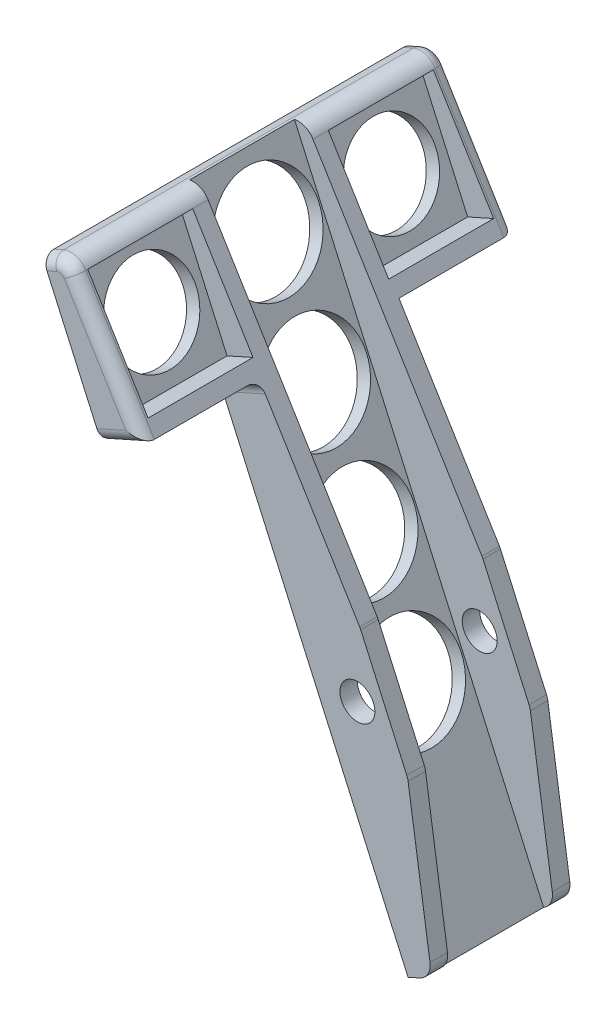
from build123d import *

# Parameters (mm, degrees)
ESQUISSE1_R             = 3.000000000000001
BOSS_EXTRU_1_DEPTH      = 3
BOSS_EXTRU_2_DEPTH      = 18
ESQUISSE4_R             = 3.0000000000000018
BOSS_EXTRU_3_DEPTH      = 3
CONG_1_R                = 3
CONG_2_R                = 3
ENL_V_MAT_EXTRU_2_DEPTH = 103.74467621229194
CONG_3_R                = 3
BOSS_EXTRU_4_DEPTH      = 20
BOSS_EXTRU_5_START      = 20
BOSS_EXTRU_5_DEPTH      = 20
CONG_4_R                = 2
ESQUISSE10_R            = 8.751073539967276
ESQUISSE10_R_2          = 8.751073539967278
ESQUISSE10_R_3          = 7.657402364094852
ESQUISSE10_R_4          = 7.657402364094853
ENL_V_MAT_EXTRU_3_DEPTH = 20
ESQUISSE13_W            = 18.028773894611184
ESQUISSE13_H            = 19.701931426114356
ENL_V_MAT_EXTRU_4_DEPTH = 20


with BuildPart() as part:
    # Esquisse1 → Boss.-Extru.1 (new body)
    with BuildSketch(Plane.XY.offset(-3.00000000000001)):
        Polygon((8.695260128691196, -5.909633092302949), (-34.11892264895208, 89.9650025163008), (-23.16182143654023, 94.8580519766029), (19.65236134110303, -1.0165836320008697), align=None)
        with Locations((0, 30.729041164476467)):
            Circle(ESQUISSE1_R, mode=Mode.SUBTRACT)
    extrude(amount=-BOSS_EXTRU_1_DEPTH)

    # Esquisse3 → Boss.-Extru.2 (add)
    with BuildSketch(Plane(origin=(0, 0, -6.000000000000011), x_dir=(-1, 0, 0), z_dir=(0, 0, -1))):
        Polygon((34.11892264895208, 89.9650025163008), (-8.695260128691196, -5.909633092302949), (-10.97798954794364, -4.890247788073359), (31.83619322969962, 90.98438782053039), align=None)
    extrude(amount=BOSS_EXTRU_2_DEPTH)

    # Esquisse4 → Boss.-Extru.3 (add)
    with BuildSketch(Plane(origin=(0, 0, -24.000000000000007), x_dir=(-1, 0, 0), z_dir=(0, 0, -1))):
        Polygon((-19.65236134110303, -1.0165836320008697), (-8.695260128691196, -5.909633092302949), (34.11892264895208, 89.9650025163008), (23.16182143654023, 94.8580519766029), align=None)
        with Locations(Location((0, 30.729041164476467, 0), (0, 0, 180))):
            Circle(ESQUISSE4_R, mode=Mode.SUBTRACT)
    extrude(amount=BOSS_EXTRU_3_DEPTH)

    # Cong_1
    cong_1_edges = [part.edges().sort_by_distance(p)[0] for p in [
        (19.65236134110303, -1.0165836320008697, -25.500000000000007),
        (19.65236134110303, -1.0165836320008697, -4.500000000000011),
    ]]
    fillet(cong_1_edges, radius=CONG_1_R)

    # Cong_2
    cong_2_edges = [part.edges().sort_by_distance(p)[0] for p in [
        (-23.16182143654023, 94.8580519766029, -25.500000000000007),
        (-23.16182143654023, 94.8580519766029, -4.500000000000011),
    ]]
    fillet(cong_2_edges, radius=CONG_2_R)

    # Esquisse9 → Enl_v. mat.-Extru.2 (cut, through all)
    with BuildSketch(Plane.XY.offset(-3.00000000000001)):
        with BuildLine():
            Line((0.4879176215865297, 41.898729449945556), (-30.01000969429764, 91.79989606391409))
            Line((-30.01000969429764, 91.79989606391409), (-25.9010967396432, 93.63478961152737))
            ThreePointArc((-25.9010967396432, 93.63478961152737), (-23.605851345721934, 93.69745156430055), (-21.938559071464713, 92.11877667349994))
            Line((-21.938559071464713, 92.11877667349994), (0.4879176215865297, 41.898729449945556))
        make_face()
        with BuildLine():
            Line((8.643000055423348, 23.636894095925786), (12.804173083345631, -4.07473954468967))
            Line((12.804173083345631, -4.07473954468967), (16.91308603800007, -2.239845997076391))
            ThreePointArc((16.91308603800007, -2.239845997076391), (18.49176092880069, -0.5725537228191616), (18.429098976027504, 1.7226916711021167))
            Line((18.429098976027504, 1.7226916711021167), (8.643000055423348, 23.636894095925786))
        make_face()
    extrude(amount=-ENL_V_MAT_EXTRU_2_DEPTH, mode=Mode.SUBTRACT)

    # Cong_3
    cong_3_edges = [part.edges().sort_by_distance(p)[0] for p in [
        (-30.01000969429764, 91.79989606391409, -25.500000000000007),
        (0.4879176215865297, 41.898729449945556, -4.500000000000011),
        (0.4879176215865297, 41.898729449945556, -25.500000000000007),
        (8.643000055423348, 23.636894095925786, -4.500000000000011),
        (8.643000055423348, 23.636894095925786, -25.500000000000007),
        (12.804173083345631, -4.07473954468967, -25.500000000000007),
    ]]
    fillet(cong_3_edges, radius=CONG_3_R)

    # Esquisse11 → Boss.-Extru.4 (add)
    with BuildSketch(Plane.XY.offset(-3.00000000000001)):
        with BuildLine():
            Line((-23.925069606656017, 67.13770832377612), (-16.864351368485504, 70.29077252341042))
            Line((-16.864351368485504, 70.29077252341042), (-28.63483071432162, 89.54980756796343))
            ThreePointArc((-28.63483071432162, 89.54980756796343), (-30.304881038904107, 90.8503806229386), (-32.41787535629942, 90.72462938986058))
            Line((-32.41787535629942, 90.72462938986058), (-34.11892264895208, 89.9650025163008))
            Line((-34.11892264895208, 89.9650025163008), (-23.925069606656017, 67.13770832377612))
        make_face()
    extrude(amount=BOSS_EXTRU_4_DEPTH)

    # Esquisse12 → Boss.-Extru.5 (add)
    with BuildSketch(Plane(origin=(0, 0, -27.000000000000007), x_dir=(-1, 0, 0), z_dir=(0, 0, -1)).offset(BOSS_EXTRU_5_START)):
        with BuildLine():
            Line((34.11892264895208, 89.9650025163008), (32.41787535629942, 90.72462938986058))
            ThreePointArc((32.41787535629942, 90.72462938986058), (30.30488103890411, 90.8503806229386), (28.634830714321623, 89.54980756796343))
            Line((28.634830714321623, 89.54980756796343), (16.864351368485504, 70.29077252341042))
            Line((16.864351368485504, 70.29077252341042), (23.925069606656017, 67.13770832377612))
            Line((23.925069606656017, 67.13770832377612), (34.11892264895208, 89.9650025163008))
        make_face()
    extrude(amount=-BOSS_EXTRU_5_DEPTH)

    # Cong_4
    cong_4_edges = [part.edges().sort_by_distance(p)[0] for p in [
        (-22.749591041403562, 79.92029004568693, -47.00000000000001),
        (-30.30488103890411, 90.8503806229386, -47.00000000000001),
        (-22.749591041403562, 79.92029004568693, 16.99999999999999),
        (-30.304881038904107, 90.8503806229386, 16.99999999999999),
        (-20.394710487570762, 68.71424042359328, -47.00000000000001),
        (-33.26839900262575, 90.34481595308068, -47.00000000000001),
        (-33.26839900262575, 90.34481595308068, 16.99999999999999),
        (-20.394710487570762, 68.71424042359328, 16.99999999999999),
        (-20.394710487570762, 68.71424042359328, -3.00000000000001),
    ]]
    fillet(cong_4_edges, radius=CONG_4_R)

    # Esquisse10 → Enl_v. mat.-Extru.3 (cut)
    with BuildSketch(Plane(origin=(5.0492999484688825, 2.254836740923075, 0), x_dir=(0, 0, 1), z_dir=(-0.9130917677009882, -0.40775412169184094, 0))):
        with Locations(Location((-15.000000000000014, 85.04040791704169, 0), (0, 0, 270))):
            Circle(ESQUISSE10_R)
        with Locations(Location((-14.999999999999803, 65.04040791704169, 0), (0, 0, 270))):
            Circle(ESQUISSE10_R)
        with Locations(Location((-14.999999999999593, 45.04040791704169, 0), (0, 0, 270))):
            Circle(ESQUISSE10_R_2)
        with Locations(Location((-14.999999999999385, 25.040407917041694, 0), (0, 0, 270))):
            Circle(ESQUISSE10_R)
        with Locations(Location((-35.584989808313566, 83.55843451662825, 0), (0, 0, 270))):
            Circle(ESQUISSE10_R_3)
        with Locations(Location((5.584989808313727, 83.55843451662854, 0), (0, 0, 90))):
            Circle(ESQUISSE10_R_4)
    extrude(amount=-ENL_V_MAT_EXTRU_3_DEPTH, mode=Mode.SUBTRACT)

    # Esquisse13 → Enl_v. mat.-Extru.4 (cut)
    with BuildSketch(Plane(origin=(7.332029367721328, 3.2742220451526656, 0), x_dir=(0, 0, -1), z_dir=(0.9130917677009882, 0.4077541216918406, 0))):
        with Locations((-5.65929207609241, 83.59219662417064)):
            Rectangle(ESQUISSE13_W, ESQUISSE13_H)
        Polygon((26.644905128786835, 93.44316233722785), (26.644905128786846, 73.74123091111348), (44.67367902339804, 73.74123091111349), (44.67367902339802, 93.44316233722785), align=None)
    extrude(amount=ENL_V_MAT_EXTRU_4_DEPTH, mode=Mode.SUBTRACT)


solid = part.part
